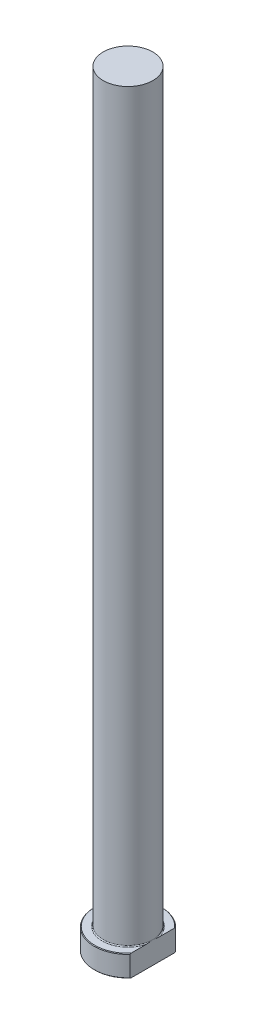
ISO-10303-21;
HEADER;
FILE_DESCRIPTION(('STEP AP214'),'2;1');
FILE_NAME('part.step','',(''),(''),'','','');
FILE_SCHEMA(('AUTOMOTIVE_DESIGN { 1 0 10303 214 1 1 1 1 }'));
ENDSEC;
DATA;
#1=APPLICATION_CONTEXT('core data for automotive mechanical design processes');
#2=APPLICATION_PROTOCOL_DEFINITION('international standard','automotive_design',2000,#1);
#3=PRODUCT_CONTEXT('',#1,'mechanical');
#4=PRODUCT('Part','Part','',(#3));
#5=PRODUCT_RELATED_PRODUCT_CATEGORY('part','',(#4));
#6=PRODUCT_DEFINITION_FORMATION('','',#4);
#7=PRODUCT_DEFINITION_CONTEXT('part definition',#1,'design');
#8=PRODUCT_DEFINITION('design','',#6,#7);
#9=PRODUCT_DEFINITION_SHAPE('','',#8);
#10=(LENGTH_UNIT() NAMED_UNIT(*) SI_UNIT(.MILLI.,.METRE.));
#11=(NAMED_UNIT(*) PLANE_ANGLE_UNIT() SI_UNIT($,.RADIAN.));
#12=(NAMED_UNIT(*) SI_UNIT($,.STERADIAN.) SOLID_ANGLE_UNIT());
#13=UNCERTAINTY_MEASURE_WITH_UNIT(LENGTH_MEASURE(1.E-05),#10,'distance_accuracy_value','');
#14=(GEOMETRIC_REPRESENTATION_CONTEXT(3) GLOBAL_UNCERTAINTY_ASSIGNED_CONTEXT((#13)) GLOBAL_UNIT_ASSIGNED_CONTEXT((#10,
#11,#12)) REPRESENTATION_CONTEXT('',''));
#15=CARTESIAN_POINT('',(0.,0.,0.));
#16=DIRECTION('',(0.,0.,1.));
#17=DIRECTION('',(1.,0.,0.));
#18=AXIS2_PLACEMENT_3D('',#15,#16,#17);
#19=CARTESIAN_POINT('',(0.,0.,0.));
#20=DIRECTION('',(0.,-1.,0.));
#21=DIRECTION('',(0.,0.,-1.));
#22=AXIS2_PLACEMENT_3D('',#19,#20,#21);
#23=PLANE('',#22);
#24=CARTESIAN_POINT('',(0.,0.,0.));
#25=DIRECTION('',(0.,-1.,0.));
#26=DIRECTION('',(0.,0.,-1.));
#27=AXIS2_PLACEMENT_3D('',#24,#25,#26);
#28=CIRCLE('',#27,10.7999999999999);
#29=CARTESIAN_POINT('',(8.09999999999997,0.,7.14352853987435));
#30=VERTEX_POINT('',#29);
#31=CARTESIAN_POINT('',(8.09999999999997,0.,-7.14352853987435));
#32=VERTEX_POINT('',#31);
#33=EDGE_CURVE('E98',#30,#32,#28,.T.);
#34=ORIENTED_EDGE('',*,*,#33,.T.);
#35=DIRECTION('',(0.,0.,1.));
#36=VECTOR('',#35,1.);
#37=CARTESIAN_POINT('',(8.09999999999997,0.,-7.44244583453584));
#38=LINE('',#37,#36);
#39=EDGE_CURVE('E83',#32,#30,#38,.T.);
#40=ORIENTED_EDGE('',*,*,#39,.T.);
#41=EDGE_LOOP('',(#34,#40));
#42=FACE_BOUND('',#41,.T.);
#43=ADVANCED_FACE('F32',(#42),#23,.T.);
#44=CARTESIAN_POINT('',(0.,259.958771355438,0.));
#45=DIRECTION('',(0.,1.,0.));
#46=DIRECTION('',(0.,0.,1.));
#47=AXIS2_PLACEMENT_3D('',#44,#45,#46);
#48=CYLINDRICAL_SURFACE('',#47,11.);
#49=CARTESIAN_POINT('',(0.,6.79999999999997,0.));
#50=DIRECTION('',(0.,1.,0.));
#51=DIRECTION('',(0.,0.,1.));
#52=AXIS2_PLACEMENT_3D('',#49,#50,#51);
#53=CIRCLE('',#52,11.);
#54=CARTESIAN_POINT('',(8.09999999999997,6.79999999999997,7.44244583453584));
#55=VERTEX_POINT('',#54);
#56=CARTESIAN_POINT('',(8.09999999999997,6.79999999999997,-7.44244583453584));
#57=VERTEX_POINT('',#56);
#58=EDGE_CURVE('E104',#55,#57,#53,.F.);
#59=ORIENTED_EDGE('',*,*,#58,.T.);
#60=DIRECTION('',(0.,-1.,0.));
#61=VECTOR('',#60,1.);
#62=CARTESIAN_POINT('',(8.09999999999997,250.,-7.44244583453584));
#63=LINE('',#62,#61);
#64=CARTESIAN_POINT('',(8.09999999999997,0.200000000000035,-7.44244583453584));
#65=VERTEX_POINT('',#64);
#66=EDGE_CURVE('E183',#57,#65,#63,.T.);
#67=ORIENTED_EDGE('',*,*,#66,.T.);
#68=CARTESIAN_POINT('',(0.,0.200000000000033,0.));
#69=DIRECTION('',(0.,-1.,0.));
#70=DIRECTION('',(0.,0.,-1.));
#71=AXIS2_PLACEMENT_3D('',#68,#69,#70);
#72=CIRCLE('',#71,11.);
#73=CARTESIAN_POINT('',(8.09999999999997,0.200000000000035,7.44244583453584));
#74=VERTEX_POINT('',#73);
#75=EDGE_CURVE('E100',#65,#74,#72,.F.);
#76=ORIENTED_EDGE('',*,*,#75,.T.);
#77=DIRECTION('',(0.,-1.,0.));
#78=VECTOR('',#77,1.);
#79=CARTESIAN_POINT('',(8.09999999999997,250.,7.44244583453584));
#80=LINE('',#79,#78);
#81=EDGE_CURVE('E93',#55,#74,#80,.T.);
#82=ORIENTED_EDGE('',*,*,#81,.F.);
#83=EDGE_LOOP('',(#59,#67,#76,#82));
#84=FACE_BOUND('',#83,.T.);
#85=ADVANCED_FACE('F158',(#84),#48,.T.);
#86=CARTESIAN_POINT('',(-11.,7.,0.));
#87=DIRECTION('',(0.,1.,0.));
#88=DIRECTION('',(0.,0.,1.));
#89=AXIS2_PLACEMENT_3D('',#86,#87,#88);
#90=PLANE('',#89);
#91=CARTESIAN_POINT('',(0.,7.,0.));
#92=DIRECTION('',(0.,1.,0.));
#93=DIRECTION('',(0.,0.,1.));
#94=AXIS2_PLACEMENT_3D('',#91,#92,#93);
#95=CIRCLE('',#94,10.8);
#96=CARTESIAN_POINT('',(8.09999999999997,7.,-7.14352853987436));
#97=VERTEX_POINT('',#96);
#98=CARTESIAN_POINT('',(8.09999999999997,7.,7.14352853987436));
#99=VERTEX_POINT('',#98);
#100=EDGE_CURVE('E178',#97,#99,#95,.T.);
#101=ORIENTED_EDGE('',*,*,#100,.T.);
#102=DIRECTION('',(0.,0.,-1.));
#103=VECTOR('',#102,1.);
#104=CARTESIAN_POINT('',(8.09999999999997,7.,0.));
#105=LINE('',#104,#103);
#106=CARTESIAN_POINT('',(8.09999999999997,6.99999999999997,2.22485954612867));
#107=VERTEX_POINT('',#106);
#108=EDGE_CURVE('E57',#99,#107,#105,.T.);
#109=ORIENTED_EDGE('',*,*,#108,.T.);
#110=CARTESIAN_POINT('',(0.,7.,0.));
#111=DIRECTION('',(0.,1.,0.));
#112=DIRECTION('',(0.,0.,1.));
#113=AXIS2_PLACEMENT_3D('',#110,#111,#112);
#114=CIRCLE('',#113,8.39999999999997);
#115=CARTESIAN_POINT('',(8.09999999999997,6.99999999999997,-2.22485954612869));
#116=VERTEX_POINT('',#115);
#117=EDGE_CURVE('E107',#107,#116,#114,.F.);
#118=ORIENTED_EDGE('',*,*,#117,.T.);
#119=EDGE_CURVE('E136',#116,#97,#105,.T.);
#120=ORIENTED_EDGE('',*,*,#119,.T.);
#121=EDGE_LOOP('',(#101,#109,#118,#120));
#122=FACE_BOUND('',#121,.T.);
#123=ADVANCED_FACE('F147',(#122),#90,.T.);
#124=CARTESIAN_POINT('',(0.,7.00000000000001,0.));
#125=DIRECTION('',(0.,-1.,0.));
#126=DIRECTION('',(0.,0.,-1.));
#127=AXIS2_PLACEMENT_3D('',#124,#125,#126);
#128=CONICAL_SURFACE('',#127,10.7999999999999,0.785398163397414);
#129=ORIENTED_EDGE('',*,*,#58,.F.);
#130=CARTESIAN_POINT('',(8.09999999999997,-0.468293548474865,16.3743869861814));
#131=CARTESIAN_POINT('',(8.09999999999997,-0.254363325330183,16.1357074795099));
#132=CARTESIAN_POINT('',(8.09999999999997,-0.0409370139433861,15.8965760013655));
#133=CARTESIAN_POINT('',(8.09999999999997,0.384762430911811,15.4172842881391));
#134=CARTESIAN_POINT('',(8.09999999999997,0.597035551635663,15.1771240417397));
#135=CARTESIAN_POINT('',(8.09999999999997,1.23203735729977,14.454764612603));
#136=CARTESIAN_POINT('',(8.09999999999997,1.65280946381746,13.9708414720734));
#137=CARTESIAN_POINT('',(8.09999999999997,2.49198203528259,12.9919134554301));
#138=CARTESIAN_POINT('',(8.09999999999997,2.91030911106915,12.4968454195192));
#139=CARTESIAN_POINT('',(8.09999999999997,3.53063151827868,11.7483710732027));
#140=CARTESIAN_POINT('',(8.09999999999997,3.73619473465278,11.4979212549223));
#141=CARTESIAN_POINT('',(8.09999999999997,4.14450356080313,10.9947372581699));
#142=CARTESIAN_POINT('',(8.09999999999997,4.34724920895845,10.7420031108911));
#143=CARTESIAN_POINT('',(8.09999999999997,4.73433340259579,10.2529152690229));
#144=CARTESIAN_POINT('',(8.09999999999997,4.91891315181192,10.0167526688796));
#145=CARTESIAN_POINT('',(8.09999999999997,5.28467709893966,9.54181650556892));
#146=CARTESIAN_POINT('',(8.09999999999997,5.46586137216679,9.30304300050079));
#147=CARTESIAN_POINT('',(8.09999999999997,5.82427381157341,8.82234050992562));
#148=CARTESIAN_POINT('',(8.09999999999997,6.00149981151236,8.58040990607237));
#149=CARTESIAN_POINT('',(8.09999999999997,6.35105499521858,8.09303329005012));
#150=CARTESIAN_POINT('',(8.09999999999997,6.52338425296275,7.84758733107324));
#151=CARTESIAN_POINT('',(8.09999999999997,6.86170981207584,7.35313784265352));
#152=CARTESIAN_POINT('',(8.09999999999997,7.02771904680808,7.10414319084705));
#153=CARTESIAN_POINT('',(8.09999999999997,7.35243924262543,6.60139153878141));
#154=CARTESIAN_POINT('',(8.09999999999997,7.51114961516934,6.34763415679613));
#155=CARTESIAN_POINT('',(8.09999999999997,7.81934238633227,5.83485140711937));
#156=CARTESIAN_POINT('',(8.09999999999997,7.96883276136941,5.57583085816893));
#157=CARTESIAN_POINT('',(8.09999999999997,8.25640202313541,5.05156426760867));
#158=CARTESIAN_POINT('',(8.09999999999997,8.39448364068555,4.7863197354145));
#159=CARTESIAN_POINT('',(8.09999999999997,8.6473354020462,4.2672067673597));
#160=CARTESIAN_POINT('',(8.09999999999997,8.76305451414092,4.01380392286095));
#161=CARTESIAN_POINT('',(8.09999999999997,8.97906757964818,3.50043611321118));
#162=CARTESIAN_POINT('',(8.09999999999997,9.07936141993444,3.24047109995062));
#163=CARTESIAN_POINT('',(8.09999999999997,9.26061269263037,2.7150721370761));
#164=CARTESIAN_POINT('',(8.09999999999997,9.34165272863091,2.4496670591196));
#165=CARTESIAN_POINT('',(8.09999999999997,9.48121180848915,1.91293243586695));
#166=CARTESIAN_POINT('',(8.09999999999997,9.53973286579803,1.64160342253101));
#167=CARTESIAN_POINT('',(8.09999999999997,9.63162156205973,1.08977238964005));
#168=CARTESIAN_POINT('',(8.09999999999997,9.66453368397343,0.809192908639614));
#169=CARTESIAN_POINT('',(8.09999999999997,9.70112845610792,0.246139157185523));
#170=CARTESIAN_POINT('',(8.09999999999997,9.70481576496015,-0.0363348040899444));
#171=CARTESIAN_POINT('',(8.09999999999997,9.68267265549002,-0.600479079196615));
#172=CARTESIAN_POINT('',(8.09999999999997,9.65680275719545,-0.882147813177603));
#173=CARTESIAN_POINT('',(8.09999999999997,9.57739238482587,-1.44154939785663));
#174=CARTESIAN_POINT('',(8.09999999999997,9.52384373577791,-1.71928106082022));
#175=CARTESIAN_POINT('',(8.09999999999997,9.37717365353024,-2.33286612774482));
#176=CARTESIAN_POINT('',(8.09999999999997,9.2777409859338,-2.6671944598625));
#177=CARTESIAN_POINT('',(8.09999999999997,9.04935963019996,-3.32555561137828));
#178=CARTESIAN_POINT('',(8.09999999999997,8.92039733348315,-3.64958360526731));
#179=CARTESIAN_POINT('',(8.09999999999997,8.70907658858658,-4.12987142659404));
#180=CARTESIAN_POINT('',(8.09999999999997,8.63516457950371,-4.28993932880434));
#181=CARTESIAN_POINT('',(8.09999999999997,8.48223226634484,-4.6076232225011));
#182=CARTESIAN_POINT('',(8.09999999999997,8.4032119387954,-4.76523920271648));
#183=CARTESIAN_POINT('',(8.09999999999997,8.24075032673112,-5.07810202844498));
#184=CARTESIAN_POINT('',(8.09999999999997,8.1573104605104,-5.23334961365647));
#185=CARTESIAN_POINT('',(8.09999999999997,7.98654878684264,-5.54168695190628));
#186=CARTESIAN_POINT('',(8.09999999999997,7.89922702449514,-5.6947767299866));
#187=CARTESIAN_POINT('',(8.09999999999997,7.66338960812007,-6.09772881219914));
#188=CARTESIAN_POINT('',(8.09999999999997,7.5119549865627,-6.34588392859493));
#189=CARTESIAN_POINT('',(8.09999999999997,7.20164049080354,-6.83751069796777));
#190=CARTESIAN_POINT('',(8.09999999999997,7.04275963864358,-7.08098172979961));
#191=CARTESIAN_POINT('',(8.09999999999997,6.71886431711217,-7.56397194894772));
#192=CARTESIAN_POINT('',(8.09999999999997,6.55384686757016,-7.80348913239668));
#193=CARTESIAN_POINT('',(8.09999999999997,6.21883875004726,-8.27899456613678));
#194=CARTESIAN_POINT('',(8.09999999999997,6.04884829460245,-8.51498296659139));
#195=CARTESIAN_POINT('',(8.09999999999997,5.70426867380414,-8.98455504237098));
#196=CARTESIAN_POINT('',(8.09999999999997,5.52966831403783,-9.21813048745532));
#197=CARTESIAN_POINT('',(8.09999999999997,5.17697958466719,-9.68263613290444));
#198=CARTESIAN_POINT('',(8.09999999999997,4.99889113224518,-9.91356627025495));
#199=CARTESIAN_POINT('',(8.09999999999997,4.46033384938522,-10.6027922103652));
#200=CARTESIAN_POINT('',(8.09999999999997,4.0954736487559,-11.0576577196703));
#201=CARTESIAN_POINT('',(8.09999999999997,3.38639212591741,-11.9247254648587));
#202=CARTESIAN_POINT('',(8.09999999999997,3.04281718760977,-12.337459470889));
#203=CARTESIAN_POINT('',(8.09999999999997,2.35005516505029,-13.1582374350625));
#204=CARTESIAN_POINT('',(8.09999999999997,2.00086766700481,-13.5662810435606));
#205=CARTESIAN_POINT('',(8.09999999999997,1.30027764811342,-14.3760884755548));
#206=CARTESIAN_POINT('',(8.09999999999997,0.94890184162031,-14.7778754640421));
#207=CARTESIAN_POINT('',(8.09999999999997,0.242699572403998,-15.57830831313));
#208=CARTESIAN_POINT('',(8.09999999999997,-0.112126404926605,-15.9769546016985));
#209=CARTESIAN_POINT('',(8.09999999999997,-0.468293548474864,-16.3743869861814));
#210=B_SPLINE_CURVE_WITH_KNOTS('',3,(#130,#131,#132,#133,#134,#135,#136,#137,#138,#139,#140,
#141,#142,#143,#144,#145,#146,#147,#148,#149,#150,#151,#152,#153,#154,#155,#156,#157,#158,#159,
#160,#161,#162,#163,#164,#165,#166,#167,#168,#169,#170,#171,#172,#173,#174,#175,#176,#177,#178,
#179,#180,#181,#182,#183,#184,#185,#186,#187,#188,#189,#190,#191,#192,#193,#194,#195,#196,#197,
#198,#199,#200,#201,#202,#203,#204,#205,#206,#207,#208,#209),.UNSPECIFIED.,.F.,.F.,(4,2,2,2,2,2,
2,2,2,2,2,2,2,2,2,2,2,2,2,2,2,2,2,2,2,2,2,2,2,2,2,2,2,2,2,2,2,2,2,4),(0.,0.961563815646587,
1.92313823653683,3.84691108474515,5.79124096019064,6.76324981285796,7.73524541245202,
8.63443178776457,9.53359819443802,10.4332451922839,11.3328785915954,12.2305594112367,
13.1283124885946,14.0252776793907,14.9220275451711,15.7573406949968,16.5926599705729,
17.424328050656,18.2559217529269,19.1019891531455,19.9479216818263,20.7949854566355,
21.6422995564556,22.6869149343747,23.732012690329,24.2608671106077,24.7897239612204,
25.3184121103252,25.8470941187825,26.7190513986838,27.5911235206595,28.4636248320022,
29.3360889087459,30.2109126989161,31.085757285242,32.8349455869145,34.4459592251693,
36.0570921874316,37.6583452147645,39.2593761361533),.UNSPECIFIED.);
#211=EDGE_CURVE('E135',#55,#99,#210,.T.);
#212=ORIENTED_EDGE('',*,*,#211,.T.);
#213=ORIENTED_EDGE('',*,*,#100,.F.);
#214=EDGE_CURVE('E127',#97,#57,#210,.T.);
#215=ORIENTED_EDGE('',*,*,#214,.T.);
#216=EDGE_LOOP('',(#129,#212,#213,#215));
#217=FACE_BOUND('',#216,.T.);
#218=ADVANCED_FACE('F143',(#217),#128,.T.);
#219=CARTESIAN_POINT('',(0.,0.200000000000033,0.));
#220=DIRECTION('',(0.,1.,0.));
#221=DIRECTION('',(0.,0.,1.));
#222=AXIS2_PLACEMENT_3D('',#219,#220,#221);
#223=CONICAL_SURFACE('',#222,11.,0.785398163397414);
#224=ORIENTED_EDGE('',*,*,#75,.F.);
#225=CARTESIAN_POINT('',(8.09999999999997,7.46829354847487,-16.3743869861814));
#226=CARTESIAN_POINT('',(8.09999999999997,7.25436332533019,-16.1357074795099));
#227=CARTESIAN_POINT('',(8.09999999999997,7.04093701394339,-15.8965760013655));
#228=CARTESIAN_POINT('',(8.09999999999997,6.6152375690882,-15.4172842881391));
#229=CARTESIAN_POINT('',(8.09999999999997,6.40296444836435,-15.1771240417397));
#230=CARTESIAN_POINT('',(8.09999999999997,5.76796264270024,-14.454764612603));
#231=CARTESIAN_POINT('',(8.09999999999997,5.34719053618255,-13.9708414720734));
#232=CARTESIAN_POINT('',(8.09999999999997,4.50801796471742,-12.9919134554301));
#233=CARTESIAN_POINT('',(8.09999999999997,4.08969088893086,-12.4968454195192));
#234=CARTESIAN_POINT('',(8.09999999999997,3.46936848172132,-11.7483710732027));
#235=CARTESIAN_POINT('',(8.09999999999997,3.26380526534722,-11.4979212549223));
#236=CARTESIAN_POINT('',(8.09999999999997,2.85549643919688,-10.9947372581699));
#237=CARTESIAN_POINT('',(8.09999999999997,2.65275079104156,-10.7420031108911));
#238=CARTESIAN_POINT('',(8.09999999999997,2.26566659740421,-10.2529152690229));
#239=CARTESIAN_POINT('',(8.09999999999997,2.08108684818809,-10.0167526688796));
#240=CARTESIAN_POINT('',(8.09999999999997,1.71532290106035,-9.54181650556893));
#241=CARTESIAN_POINT('',(8.09999999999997,1.53413862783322,-9.30304300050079));
#242=CARTESIAN_POINT('',(8.09999999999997,1.1757261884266,-8.82234050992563));
#243=CARTESIAN_POINT('',(8.09999999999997,0.998500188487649,-8.58040990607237));
#244=CARTESIAN_POINT('',(8.09999999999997,0.648945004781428,-8.09303329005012));
#245=CARTESIAN_POINT('',(8.09999999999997,0.476615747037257,-7.84758733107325));
#246=CARTESIAN_POINT('',(8.09999999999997,0.138290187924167,-7.35313784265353));
#247=CARTESIAN_POINT('',(8.09999999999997,-0.0277190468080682,-7.10414319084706));
#248=CARTESIAN_POINT('',(8.09999999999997,-0.352439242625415,-6.60139153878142));
#249=CARTESIAN_POINT('',(8.09999999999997,-0.511149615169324,-6.34763415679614));
#250=CARTESIAN_POINT('',(8.09999999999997,-0.819342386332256,-5.83485140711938));
#251=CARTESIAN_POINT('',(8.09999999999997,-0.968832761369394,-5.57583085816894));
#252=CARTESIAN_POINT('',(8.09999999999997,-1.2564020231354,-5.05156426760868));
#253=CARTESIAN_POINT('',(8.09999999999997,-1.39448364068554,-4.78631973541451));
#254=CARTESIAN_POINT('',(8.09999999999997,-1.64733540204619,-4.26720676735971));
#255=CARTESIAN_POINT('',(8.09999999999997,-1.76305451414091,-4.01380392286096));
#256=CARTESIAN_POINT('',(8.09999999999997,-1.97906757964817,-3.50043611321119));
#257=CARTESIAN_POINT('',(8.09999999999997,-2.07936141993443,-3.24047109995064));
#258=CARTESIAN_POINT('',(8.09999999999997,-2.26061269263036,-2.71507213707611));
#259=CARTESIAN_POINT('',(8.09999999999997,-2.3416527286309,-2.44966705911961));
#260=CARTESIAN_POINT('',(8.09999999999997,-2.48121180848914,-1.91293243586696));
#261=CARTESIAN_POINT('',(8.09999999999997,-2.53973286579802,-1.64160342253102));
#262=CARTESIAN_POINT('',(8.09999999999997,-2.63162156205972,-1.08977238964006));
#263=CARTESIAN_POINT('',(8.09999999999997,-2.66453368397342,-0.809192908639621));
#264=CARTESIAN_POINT('',(8.09999999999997,-2.70112845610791,-0.24613915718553));
#265=CARTESIAN_POINT('',(8.09999999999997,-2.70481576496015,0.0363348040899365));
#266=CARTESIAN_POINT('',(8.09999999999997,-2.68267265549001,0.600479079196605));
#267=CARTESIAN_POINT('',(8.09999999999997,-2.65680275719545,0.882147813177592));
#268=CARTESIAN_POINT('',(8.09999999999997,-2.57739238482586,1.44154939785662));
#269=CARTESIAN_POINT('',(8.09999999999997,-2.52384373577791,1.71928106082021));
#270=CARTESIAN_POINT('',(8.09999999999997,-2.37717365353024,2.33286612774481));
#271=CARTESIAN_POINT('',(8.09999999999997,-2.2777409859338,2.66719445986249));
#272=CARTESIAN_POINT('',(8.09999999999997,-2.04935963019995,3.32555561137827));
#273=CARTESIAN_POINT('',(8.09999999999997,-1.92039733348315,3.6495836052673));
#274=CARTESIAN_POINT('',(8.09999999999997,-1.70907658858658,4.12987142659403));
#275=CARTESIAN_POINT('',(8.09999999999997,-1.63516457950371,4.28993932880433));
#276=CARTESIAN_POINT('',(8.09999999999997,-1.48223226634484,4.60762322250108));
#277=CARTESIAN_POINT('',(8.09999999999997,-1.4032119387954,4.76523920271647));
#278=CARTESIAN_POINT('',(8.09999999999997,-1.24075032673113,5.07810202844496));
#279=CARTESIAN_POINT('',(8.09999999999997,-1.1573104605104,5.23334961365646));
#280=CARTESIAN_POINT('',(8.09999999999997,-0.986548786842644,5.54168695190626));
#281=CARTESIAN_POINT('',(8.09999999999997,-0.899227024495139,5.69477672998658));
#282=CARTESIAN_POINT('',(8.09999999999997,-0.663389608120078,6.09772881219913));
#283=CARTESIAN_POINT('',(8.09999999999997,-0.511954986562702,6.34588392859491));
#284=CARTESIAN_POINT('',(8.09999999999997,-0.201640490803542,6.83751069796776));
#285=CARTESIAN_POINT('',(8.09999999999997,-0.0427596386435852,7.08098172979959));
#286=CARTESIAN_POINT('',(8.09999999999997,0.281135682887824,7.56397194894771));
#287=CARTESIAN_POINT('',(8.09999999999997,0.446153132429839,7.80348913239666));
#288=CARTESIAN_POINT('',(8.09999999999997,0.781161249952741,8.27899456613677));
#289=CARTESIAN_POINT('',(8.09999999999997,0.951151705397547,8.51498296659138));
#290=CARTESIAN_POINT('',(8.09999999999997,1.29573132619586,8.98455504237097));
#291=CARTESIAN_POINT('',(8.09999999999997,1.47033168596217,9.21813048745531));
#292=CARTESIAN_POINT('',(8.09999999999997,1.82302041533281,9.68263613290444));
#293=CARTESIAN_POINT('',(8.09999999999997,2.00110886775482,9.91356627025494));
#294=CARTESIAN_POINT('',(8.09999999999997,2.53966615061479,10.6027922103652));
#295=CARTESIAN_POINT('',(8.09999999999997,2.90452635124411,11.0576577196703));
#296=CARTESIAN_POINT('',(8.09999999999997,3.6136078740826,11.9247254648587));
#297=CARTESIAN_POINT('',(8.09999999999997,3.95718281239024,12.337459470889));
#298=CARTESIAN_POINT('',(8.09999999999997,4.64994483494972,13.1582374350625));
#299=CARTESIAN_POINT('',(8.09999999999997,4.9991323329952,13.5662810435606));
#300=CARTESIAN_POINT('',(8.09999999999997,5.69972235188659,14.3760884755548));
#301=CARTESIAN_POINT('',(8.09999999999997,6.0510981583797,14.7778754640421));
#302=CARTESIAN_POINT('',(8.09999999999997,6.75730042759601,15.57830831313));
#303=CARTESIAN_POINT('',(8.09999999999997,7.11212640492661,15.9769546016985));
#304=CARTESIAN_POINT('',(8.09999999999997,7.46829354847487,16.3743869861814));
#305=B_SPLINE_CURVE_WITH_KNOTS('',3,(#225,#226,#227,#228,#229,#230,#231,#232,#233,#234,#235,
#236,#237,#238,#239,#240,#241,#242,#243,#244,#245,#246,#247,#248,#249,#250,#251,#252,#253,#254,
#255,#256,#257,#258,#259,#260,#261,#262,#263,#264,#265,#266,#267,#268,#269,#270,#271,#272,#273,
#274,#275,#276,#277,#278,#279,#280,#281,#282,#283,#284,#285,#286,#287,#288,#289,#290,#291,#292,
#293,#294,#295,#296,#297,#298,#299,#300,#301,#302,#303,#304),.UNSPECIFIED.,.F.,.F.,(4,2,2,2,2,2,
2,2,2,2,2,2,2,2,2,2,2,2,2,2,2,2,2,2,2,2,2,2,2,2,2,2,2,2,2,2,2,2,2,4),(0.,0.961563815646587,
1.92313823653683,3.84691108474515,5.79124096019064,6.76324981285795,7.73524541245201,
8.63443178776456,9.53359819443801,10.4332451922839,11.3328785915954,12.2305594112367,
13.1283124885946,14.0252776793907,14.9220275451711,15.7573406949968,16.5926599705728,
17.424328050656,18.2559217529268,19.1019891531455,19.9479216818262,20.7949854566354,
21.6422995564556,22.6869149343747,23.732012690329,24.2608671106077,24.7897239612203,
25.3184121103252,25.8470941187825,26.7190513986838,27.5911235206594,28.4636248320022,
29.3360889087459,30.2109126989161,31.085757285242,32.8349455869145,34.4459592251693,
36.0570921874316,37.6583452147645,39.2593761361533),.UNSPECIFIED.);
#306=EDGE_CURVE('E86',#65,#32,#305,.T.);
#307=ORIENTED_EDGE('',*,*,#306,.T.);
#308=ORIENTED_EDGE('',*,*,#33,.F.);
#309=EDGE_CURVE('E89',#30,#74,#305,.T.);
#310=ORIENTED_EDGE('',*,*,#309,.T.);
#311=EDGE_LOOP('',(#224,#307,#308,#310));
#312=FACE_BOUND('',#311,.T.);
#313=ADVANCED_FACE('F97',(#312),#223,.T.);
#314=CARTESIAN_POINT('',(0.,7.29999999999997,0.));
#315=DIRECTION('',(0.,1.,0.));
#316=DIRECTION('',(0.,0.,1.));
#317=AXIS2_PLACEMENT_3D('',#314,#315,#316);
#318=TOROIDAL_SURFACE('',#317,8.39999999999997,0.3);
#319=CARTESIAN_POINT('',(8.09999999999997,7.29999999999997,0.));
#320=CARTESIAN_POINT('',(8.09999999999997,7.30000062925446,1.10217513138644E-10));
#321=CARTESIAN_POINT('',(8.09999999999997,7.30000125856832,-3.48372532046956E-07));
#322=CARTESIAN_POINT('',(8.09999999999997,7.30000242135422,-1.24325315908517E-06));
#323=CARTESIAN_POINT('',(8.09999999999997,7.30000291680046,-1.81407064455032E-06));
#324=CARTESIAN_POINT('',(8.09999999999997,7.30000399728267,-3.20556588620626E-06));
#325=CARTESIAN_POINT('',(8.09999999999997,7.30000456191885,-4.04857468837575E-06));
#326=CARTESIAN_POINT('',(8.09999999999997,7.30000552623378,-5.7486288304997E-06));
#327=CARTESIAN_POINT('',(8.09999999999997,7.30000593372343,-6.60186051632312E-06));
#328=CARTESIAN_POINT('',(8.09999999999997,7.30000755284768,-1.00751095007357E-05));
#329=CARTESIAN_POINT('',(8.09999999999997,7.30000870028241,-1.27308878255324E-05));
#330=CARTESIAN_POINT('',(8.09999999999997,7.30001048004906,-1.78566813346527E-05));
#331=CARTESIAN_POINT('',(8.09999999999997,7.30001115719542,-2.03116208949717E-05));
#332=CARTESIAN_POINT('',(8.09999999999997,7.30001416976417,-3.11399264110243E-05));
#333=CARTESIAN_POINT('',(8.09999999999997,7.30001656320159,-3.94979192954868E-05));
#334=CARTESIAN_POINT('',(8.09999999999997,7.30001991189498,-5.49761459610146E-05));
#335=CARTESIAN_POINT('',(8.09999999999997,7.30002104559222,-6.20568593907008E-05));
#336=CARTESIAN_POINT('',(8.09999999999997,7.30002955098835,-0.000115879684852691));
#337=CARTESIAN_POINT('',(8.09999999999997,7.30003630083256,-0.00016266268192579));
#338=CARTESIAN_POINT('',(8.09999999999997,7.30006581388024,-0.000349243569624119));
#339=CARTESIAN_POINT('',(8.09999999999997,7.30009364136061,-0.000488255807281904));
#340=CARTESIAN_POINT('',(8.09999999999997,7.30020321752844,-0.00104344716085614));
#341=CARTESIAN_POINT('',(8.09999999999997,7.30028192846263,-0.00145999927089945));
#342=CARTESIAN_POINT('',(8.09999999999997,7.30059961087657,-0.00313052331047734));
#343=CARTESIAN_POINT('',(8.09999999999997,7.30084255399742,-0.0043839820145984));
#344=CARTESIAN_POINT('',(8.09999999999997,7.30186079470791,-0.00964975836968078));
#345=CARTESIAN_POINT('',(8.09999999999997,7.30263102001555,-0.0136627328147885));
#346=CARTESIAN_POINT('',(8.09999999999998,7.30867561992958,-0.045139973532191));
#347=CARTESIAN_POINT('',(8.09999999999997,7.31396742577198,-0.0726020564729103));
#348=CARTESIAN_POINT('',(8.09999999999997,7.32431115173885,-0.126405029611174));
#349=CARTESIAN_POINT('',(8.09999999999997,7.32936401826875,-0.152745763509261));
#350=CARTESIAN_POINT('',(8.09999999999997,7.34587210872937,-0.238985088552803));
#351=CARTESIAN_POINT('',(8.09999999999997,7.35728443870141,-0.298892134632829));
#352=CARTESIAN_POINT('',(8.09999999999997,7.37648902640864,-0.400785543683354));
#353=CARTESIAN_POINT('',(8.09999999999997,7.38434094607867,-0.442760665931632));
#354=CARTESIAN_POINT('',(8.09999999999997,7.39967591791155,-0.525583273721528));
#355=CARTESIAN_POINT('',(8.09999999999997,7.40716317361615,-0.566429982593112));
#356=CARTESIAN_POINT('',(8.09999999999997,7.43255561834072,-0.706751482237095));
#357=CARTESIAN_POINT('',(8.09999999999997,7.45000488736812,-0.806310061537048));
#358=CARTESIAN_POINT('',(8.09999999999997,7.48336031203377,-1.00668681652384));
#359=CARTESIAN_POINT('',(8.09999999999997,7.49924974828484,-1.10750780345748));
#360=CARTESIAN_POINT('',(8.09999999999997,7.53002321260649,-1.31956600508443));
#361=CARTESIAN_POINT('',(8.09999999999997,7.5446499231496,-1.43084155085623));
#362=CARTESIAN_POINT('',(8.09999999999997,7.56967383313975,-1.65357260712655));
#363=CARTESIAN_POINT('',(8.09999999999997,7.58008243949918,-1.76502680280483));
#364=CARTESIAN_POINT('',(8.09999999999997,7.59481704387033,-1.98455781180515));
#365=CARTESIAN_POINT('',(8.09999999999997,7.59933894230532,-2.09261973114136));
#366=CARTESIAN_POINT('',(8.09999999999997,7.6002232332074,-2.25365680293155));
#367=CARTESIAN_POINT('',(8.09999999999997,7.59957115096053,-2.30661427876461));
#368=CARTESIAN_POINT('',(8.09999999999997,7.59593025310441,-2.41243717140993));
#369=CARTESIAN_POINT('',(8.09999999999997,7.59294242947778,-2.46530261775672));
#370=CARTESIAN_POINT('',(8.09999999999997,7.58438337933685,-2.56626617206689));
#371=CARTESIAN_POINT('',(8.09999999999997,7.57905558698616,-2.61438444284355));
#372=CARTESIAN_POINT('',(8.09999999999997,7.56511668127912,-2.71063967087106));
#373=CARTESIAN_POINT('',(8.09999999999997,7.55647540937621,-2.75877261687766));
#374=CARTESIAN_POINT('',(8.09999999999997,7.53997521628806,-2.83052401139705));
#375=CARTESIAN_POINT('',(8.09999999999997,7.5338289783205,-2.85453498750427));
#376=CARTESIAN_POINT('',(8.09999999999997,7.52005528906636,-2.90212319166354));
#377=CARTESIAN_POINT('',(8.09999999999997,7.51242879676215,-2.92570068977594));
#378=CARTESIAN_POINT('',(8.09999999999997,7.49534810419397,-2.97194486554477));
#379=CARTESIAN_POINT('',(8.09999999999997,7.48591141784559,-2.99461794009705));
#380=CARTESIAN_POINT('',(8.09999999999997,7.46452687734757,-3.0387244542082));
#381=CARTESIAN_POINT('',(8.09999999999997,7.4525885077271,-3.06016219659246));
#382=CARTESIAN_POINT('',(8.09999999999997,7.43211325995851,-3.09021268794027));
#383=CARTESIAN_POINT('',(8.09999999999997,7.42496972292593,-3.09976653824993));
#384=CARTESIAN_POINT('',(8.09999999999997,7.40960263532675,-3.11798598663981));
#385=CARTESIAN_POINT('',(8.09999999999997,7.40137953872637,-3.12665195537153));
#386=CARTESIAN_POINT('',(8.09999999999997,7.3859293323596,-3.14052845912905));
#387=CARTESIAN_POINT('',(8.09999999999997,7.37898924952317,-3.14605470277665));
#388=CARTESIAN_POINT('',(8.09999999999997,7.36434419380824,-3.15598943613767));
#389=CARTESIAN_POINT('',(8.09999999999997,7.35664068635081,-3.16040001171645));
#390=CARTESIAN_POINT('',(8.09999999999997,7.34254794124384,-3.16675602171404));
#391=CARTESIAN_POINT('',(8.09999999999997,7.33631410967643,-3.16904233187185));
#392=CARTESIAN_POINT('',(8.09999999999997,7.3235539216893,-3.17255113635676));
#393=CARTESIAN_POINT('',(8.09999999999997,7.31702793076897,-3.17377492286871));
#394=CARTESIAN_POINT('',(8.09999999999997,7.30382788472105,-3.17503459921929));
#395=CARTESIAN_POINT('',(8.09999999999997,7.29715327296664,-3.17506481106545));
#396=CARTESIAN_POINT('',(8.09999999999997,7.28390757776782,-3.1739190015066));
#397=CARTESIAN_POINT('',(8.09999999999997,7.27733655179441,-3.17274233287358));
#398=CARTESIAN_POINT('',(8.09999999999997,7.26486630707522,-3.16941116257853));
#399=CARTESIAN_POINT('',(8.09999999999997,7.25895027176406,-3.16731785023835));
#400=CARTESIAN_POINT('',(8.09999999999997,7.24746822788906,-3.16233639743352));
#401=CARTESIAN_POINT('',(8.09999999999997,7.24190232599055,-3.15944801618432));
#402=CARTESIAN_POINT('',(8.09999999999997,7.22717908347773,-3.15067054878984));
#403=CARTESIAN_POINT('',(8.09999999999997,7.21840505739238,-3.14414072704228));
#404=CARTESIAN_POINT('',(8.09999999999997,7.20193704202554,-3.129833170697));
#405=CARTESIAN_POINT('',(8.09999999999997,7.19424714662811,-3.12205093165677));
#406=CARTESIAN_POINT('',(8.09999999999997,7.17324842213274,-3.0982735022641));
#407=CARTESIAN_POINT('',(8.09999999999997,7.16115297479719,-3.08121965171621));
#408=CARTESIAN_POINT('',(8.09999999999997,7.13935274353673,-3.0457024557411));
#409=CARTESIAN_POINT('',(8.09999999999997,7.12965213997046,-3.02723671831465));
#410=CARTESIAN_POINT('',(8.09999999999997,7.10752548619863,-2.97992929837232));
#411=CARTESIAN_POINT('',(8.09999999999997,7.0962106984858,-2.95057306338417));
#412=CARTESIAN_POINT('',(8.09999999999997,7.07629636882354,-2.89093361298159));
#413=CARTESIAN_POINT('',(8.09999999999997,7.06770299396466,-2.86064846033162));
#414=CARTESIAN_POINT('',(8.09999999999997,7.05247262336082,-2.79917781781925));
#415=CARTESIAN_POINT('',(8.09999999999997,7.04586259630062,-2.76798573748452));
#416=CARTESIAN_POINT('',(8.09999999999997,7.03430884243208,-2.70534539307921));
#417=CARTESIAN_POINT('',(8.09999999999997,7.02936298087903,-2.67389751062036));
#418=CARTESIAN_POINT('',(8.09999999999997,7.01745043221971,-2.58601265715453));
#419=CARTESIAN_POINT('',(8.09999999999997,7.0119543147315,-2.52937710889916));
#420=CARTESIAN_POINT('',(8.09999999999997,7.00412918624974,-2.41587715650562));
#421=CARTESIAN_POINT('',(8.09999999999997,7.00180216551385,-2.35901263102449));
#422=CARTESIAN_POINT('',(8.09999999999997,6.99963684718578,-2.24502208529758));
#423=CARTESIAN_POINT('',(8.09999999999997,6.99980818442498,-2.18789590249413));
#424=CARTESIAN_POINT('',(8.09999999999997,7.00218365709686,-2.07368289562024));
#425=CARTESIAN_POINT('',(8.09999999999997,7.00438811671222,-2.01659607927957));
#426=CARTESIAN_POINT('',(8.09999999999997,7.01309255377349,-1.85323047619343));
#427=CARTESIAN_POINT('',(8.09999999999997,7.0216582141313,-1.74706244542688));
#428=CARTESIAN_POINT('',(8.09999999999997,7.04295526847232,-1.5351174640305));
#429=CARTESIAN_POINT('',(8.09999999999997,7.05568874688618,-1.42934073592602));
#430=CARTESIAN_POINT('',(8.09999999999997,7.08235098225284,-1.2318322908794));
#431=CARTESIAN_POINT('',(8.09999999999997,7.09591325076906,-1.14005018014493));
#432=CARTESIAN_POINT('',(8.09999999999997,7.12513315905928,-0.9542946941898));
#433=CARTESIAN_POINT('',(8.09999999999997,7.14083731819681,-0.860328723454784));
#434=CARTESIAN_POINT('',(8.09999999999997,7.16870636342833,-0.70016522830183));
#435=CARTESIAN_POINT('',(8.09999999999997,7.18055718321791,-0.633912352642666));
#436=CARTESIAN_POINT('',(8.09999999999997,7.20457571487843,-0.502251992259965));
#437=CARTESIAN_POINT('',(8.09999999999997,7.21673820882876,-0.436843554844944));
#438=CARTESIAN_POINT('',(8.09999999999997,7.2398995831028,-0.313742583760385));
#439=CARTESIAN_POINT('',(8.09999999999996,7.25086777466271,-0.256044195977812));
#440=CARTESIAN_POINT('',(8.09999999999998,7.27343224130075,-0.138123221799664));
#441=CARTESIAN_POINT('',(8.1,7.28503484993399,-0.0779017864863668));
#442=CARTESIAN_POINT('',(8.09999999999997,7.29737058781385,-0.0136537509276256));
#443=CARTESIAN_POINT('',(8.09999999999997,7.29814262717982,-0.00963182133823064));
#444=CARTESIAN_POINT('',(8.09999999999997,7.29916127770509,-0.00436406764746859));
#445=CARTESIAN_POINT('',(8.09999999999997,7.29940286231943,-0.00311759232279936));
#446=CARTESIAN_POINT('',(8.09999999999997,7.29971889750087,-0.00145572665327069));
#447=CARTESIAN_POINT('',(8.09999999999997,7.29979729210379,-0.00104084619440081));
#448=CARTESIAN_POINT('',(8.09999999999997,7.29990649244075,-0.000487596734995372));
#449=CARTESIAN_POINT('',(8.09999999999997,7.29993426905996,-0.000348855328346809));
#450=CARTESIAN_POINT('',(8.09999999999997,7.29996373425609,-0.000162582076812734));
#451=CARTESIAN_POINT('',(8.09999999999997,7.29997047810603,-0.000115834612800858));
#452=CARTESIAN_POINT('',(8.09999999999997,7.29997897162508,-6.20484364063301E-05));
#453=CARTESIAN_POINT('',(8.09999999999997,7.29998010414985,-5.49694536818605E-05));
#454=CARTESIAN_POINT('',(8.09999999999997,7.2999834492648,-3.94950080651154E-05));
#455=CARTESIAN_POINT('',(8.09999999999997,7.29998584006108,-3.11389816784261E-05));
#456=CARTESIAN_POINT('',(8.09999999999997,7.2999888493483,-2.03127732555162E-05));
#457=CARTESIAN_POINT('',(8.09999999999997,7.29998952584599,-1.78579621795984E-05));
#458=CARTESIAN_POINT('',(8.09999999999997,7.29999130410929,-1.27323428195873E-05));
#459=CARTESIAN_POINT('',(8.09999999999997,7.29999245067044,-1.00765914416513E-05));
#460=CARTESIAN_POINT('',(8.09999999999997,7.29999406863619,-6.60328060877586E-06));
#461=CARTESIAN_POINT('',(8.09999999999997,7.29999447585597,-5.74999364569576E-06));
#462=CARTESIAN_POINT('',(8.09999999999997,7.29999543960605,-4.04978039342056E-06));
#463=CARTESIAN_POINT('',(8.09999999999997,7.29999600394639,-3.2066645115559E-06));
#464=CARTESIAN_POINT('',(8.09999999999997,7.29999708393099,-1.81492874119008E-06));
#465=CARTESIAN_POINT('',(8.09999999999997,7.29999757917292,-1.24398865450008E-06));
#466=CARTESIAN_POINT('',(8.09999999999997,7.29999874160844,-3.48781227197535E-07));
#467=CARTESIAN_POINT('',(8.09999999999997,7.29999937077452,-1.10212428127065E-10));
#468=CARTESIAN_POINT('',(8.09999999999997,7.29999999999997,0.));
#469=B_SPLINE_CURVE_WITH_KNOTS('',3,(#319,#320,#321,#322,#323,#324,#325,#326,#327,#328,#329,
#330,#331,#332,#333,#334,#335,#336,#337,#338,#339,#340,#341,#342,#343,#344,#345,#346,#347,#348,
#349,#350,#351,#352,#353,#354,#355,#356,#357,#358,#359,#360,#361,#362,#363,#364,#365,#366,#367,
#368,#369,#370,#371,#372,#373,#374,#375,#376,#377,#378,#379,#380,#381,#382,#383,#384,#385,#386,
#387,#388,#389,#390,#391,#392,#393,#394,#395,#396,#397,#398,#399,#400,#401,#402,#403,#404,#405,
#406,#407,#408,#409,#410,#411,#412,#413,#414,#415,#416,#417,#418,#419,#420,#421,#422,#423,#424,
#425,#426,#427,#428,#429,#430,#431,#432,#433,#434,#435,#436,#437,#438,#439,#440,#441,#442,#443,
#444,#445,#446,#447,#448,#449,#450,#451,#452,#453,#454,#455,#456,#457,#458,#459,#460,#461,#462,
#463,#464,#465,#466,#467,#468),.UNSPECIFIED.,.T.,.F.,(4,2,2,2,2,2,2,2,2,2,2,2,2,2,2,2,2,2,2,2,2,
2,2,2,2,2,2,2,2,2,2,2,2,2,2,2,2,2,2,2,2,2,2,2,2,2,2,2,2,2,2,2,2,2,2,2,2,2,2,2,2,2,2,2,2,2,2,2,2,
2,2,2,2,2,4),(0.,1.94566340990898E-06,4.24386131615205E-06,7.26038347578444E-06,
1.00975804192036E-05,1.87517574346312E-05,2.63844155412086E-05,5.24378709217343E-05,
7.39294306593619E-05,0.000215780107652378,0.000640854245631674,0.00191288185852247,
0.00574292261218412,0.0180019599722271,0.101902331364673,0.182365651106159,0.365318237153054,
0.493427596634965,0.618009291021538,0.921227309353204,1.22740416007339,1.56404340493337,
1.89976611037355,2.22400400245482,2.38285103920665,2.54163065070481,2.68679810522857,
2.83331946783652,2.90764122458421,2.98191499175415,3.05550342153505,3.12881774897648,
3.16455086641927,3.2002690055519,3.22680903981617,3.25329908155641,3.27314054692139,
3.29295784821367,3.31286941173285,3.33279165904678,3.35154918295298,3.37031239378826,
3.40293243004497,3.43567252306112,3.49804358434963,3.5605227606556,3.65467478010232,
3.74903865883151,3.84463288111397,3.94010400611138,4.11067190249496,4.28134686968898,
4.45268021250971,4.6240408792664,4.94344863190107,5.26301637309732,5.54133137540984,
5.8271264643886,6.02903811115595,6.22862558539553,6.4048211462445,6.58880446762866,
6.60109089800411,6.6048995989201,6.60616652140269,6.60659076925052,6.6067325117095,
6.60675399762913,6.60678004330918,6.60678767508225,6.60679632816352,6.60679916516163,
6.60680218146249,6.60680447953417,6.60680642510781),.UNSPECIFIED.);
#470=CARTESIAN_POINT('',(8.09999999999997,7.29999999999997,0.));
#471=VERTEX_POINT('',#470);
#472=EDGE_CURVE('E11',#116,#471,#469,.T.);
#473=ORIENTED_EDGE('',*,*,#472,.F.);
#474=ORIENTED_EDGE('',*,*,#117,.F.);
#475=CARTESIAN_POINT('',(8.09999999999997,7.29999999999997,0.));
#476=CARTESIAN_POINT('',(8.09999999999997,7.29999937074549,-1.10217625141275E-10));
#477=CARTESIAN_POINT('',(8.09999999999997,7.29999874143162,3.48372532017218E-07));
#478=CARTESIAN_POINT('',(8.09999999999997,7.29999757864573,1.24325315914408E-06));
#479=CARTESIAN_POINT('',(8.09999999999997,7.29999708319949,1.81407064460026E-06));
#480=CARTESIAN_POINT('',(8.09999999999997,7.29999600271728,3.20556588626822E-06));
#481=CARTESIAN_POINT('',(8.09999999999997,7.29999543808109,4.04857468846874E-06));
#482=CARTESIAN_POINT('',(8.09999999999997,7.29999447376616,5.74862883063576E-06));
#483=CARTESIAN_POINT('',(8.09999999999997,7.29999406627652,6.60186051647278E-06));
#484=CARTESIAN_POINT('',(8.09999999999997,7.29999244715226,1.00751095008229E-05));
#485=CARTESIAN_POINT('',(8.09999999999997,7.29999129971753,1.27308878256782E-05));
#486=CARTESIAN_POINT('',(8.09999999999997,7.29998951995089,1.78566813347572E-05));
#487=CARTESIAN_POINT('',(8.09999999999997,7.29998884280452,2.03116208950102E-05));
#488=CARTESIAN_POINT('',(8.09999999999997,7.29998583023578,3.11399264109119E-05));
#489=CARTESIAN_POINT('',(8.09999999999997,7.29998343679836,3.94979192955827E-05));
#490=CARTESIAN_POINT('',(8.09999999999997,7.29998008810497,5.49761459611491E-05));
#491=CARTESIAN_POINT('',(8.09999999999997,7.29997895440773,6.20568593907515E-05));
#492=CARTESIAN_POINT('',(8.09999999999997,7.29997044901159,0.000115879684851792));
#493=CARTESIAN_POINT('',(8.09999999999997,7.29996369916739,0.000162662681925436));
#494=CARTESIAN_POINT('',(8.09999999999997,7.29993418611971,0.000349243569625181));
#495=CARTESIAN_POINT('',(8.09999999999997,7.29990635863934,0.000488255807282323));
#496=CARTESIAN_POINT('',(8.09999999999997,7.2997967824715,0.00104344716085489));
#497=CARTESIAN_POINT('',(8.09999999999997,7.29971807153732,0.00145999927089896));
#498=CARTESIAN_POINT('',(8.09999999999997,7.29940038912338,0.00313052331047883));
#499=CARTESIAN_POINT('',(8.09999999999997,7.29915744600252,0.004383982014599));
#500=CARTESIAN_POINT('',(8.09999999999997,7.29813920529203,0.00964975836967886));
#501=CARTESIAN_POINT('',(8.09999999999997,7.29736897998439,0.0136627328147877));
#502=CARTESIAN_POINT('',(8.09999999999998,7.2913243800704,0.0451399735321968));
#503=CARTESIAN_POINT('',(8.09999999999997,7.28603257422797,0.0726020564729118));
#504=CARTESIAN_POINT('',(8.09999999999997,7.27568884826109,0.126405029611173));
#505=CARTESIAN_POINT('',(8.09999999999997,7.27063598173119,0.15274576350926));
#506=CARTESIAN_POINT('',(8.09999999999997,7.25412789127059,0.238985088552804));
#507=CARTESIAN_POINT('',(8.09999999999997,7.24271556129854,0.29889213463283));
#508=CARTESIAN_POINT('',(8.09999999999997,7.22351097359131,0.400785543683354));
#509=CARTESIAN_POINT('',(8.09999999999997,7.21565905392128,0.442760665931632));
#510=CARTESIAN_POINT('',(8.09999999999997,7.20032408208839,0.525583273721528));
#511=CARTESIAN_POINT('',(8.09999999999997,7.19283682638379,0.566429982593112));
#512=CARTESIAN_POINT('',(8.09999999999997,7.16744438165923,0.706751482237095));
#513=CARTESIAN_POINT('',(8.09999999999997,7.14999511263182,0.806310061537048));
#514=CARTESIAN_POINT('',(8.09999999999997,7.11663968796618,1.00668681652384));
#515=CARTESIAN_POINT('',(8.09999999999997,7.1007502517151,1.10750780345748));
#516=CARTESIAN_POINT('',(8.09999999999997,7.06997678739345,1.31956600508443));
#517=CARTESIAN_POINT('',(8.09999999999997,7.05535007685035,1.43084155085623));
#518=CARTESIAN_POINT('',(8.09999999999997,7.0303261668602,1.65357260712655));
#519=CARTESIAN_POINT('',(8.09999999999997,7.01991756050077,1.76502680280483));
#520=CARTESIAN_POINT('',(8.09999999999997,7.00518295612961,1.98455781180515));
#521=CARTESIAN_POINT('',(8.09999999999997,7.00066105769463,2.09261973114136));
#522=CARTESIAN_POINT('',(8.09999999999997,6.99977676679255,2.25365680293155));
#523=CARTESIAN_POINT('',(8.09999999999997,7.00042884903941,2.30661427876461));
#524=CARTESIAN_POINT('',(8.09999999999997,7.00406974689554,2.41243717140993));
#525=CARTESIAN_POINT('',(8.09999999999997,7.00705757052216,2.46530261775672));
#526=CARTESIAN_POINT('',(8.09999999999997,7.0156166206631,2.56626617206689));
#527=CARTESIAN_POINT('',(8.09999999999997,7.02094441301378,2.61438444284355));
#528=CARTESIAN_POINT('',(8.09999999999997,7.03488331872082,2.71063967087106));
#529=CARTESIAN_POINT('',(8.09999999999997,7.04352459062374,2.75877261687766));
#530=CARTESIAN_POINT('',(8.09999999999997,7.06002478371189,2.83052401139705));
#531=CARTESIAN_POINT('',(8.09999999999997,7.06617102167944,2.85453498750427));
#532=CARTESIAN_POINT('',(8.09999999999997,7.07994471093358,2.90212319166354));
#533=CARTESIAN_POINT('',(8.09999999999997,7.0875712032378,2.92570068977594));
#534=CARTESIAN_POINT('',(8.09999999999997,7.10465189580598,2.97194486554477));
#535=CARTESIAN_POINT('',(8.09999999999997,7.11408858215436,2.99461794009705));
#536=CARTESIAN_POINT('',(8.09999999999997,7.13547312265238,3.0387244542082));
#537=CARTESIAN_POINT('',(8.09999999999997,7.14741149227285,3.06016219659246));
#538=CARTESIAN_POINT('',(8.09999999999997,7.16788674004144,3.09021268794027));
#539=CARTESIAN_POINT('',(8.09999999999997,7.17503027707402,3.09976653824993));
#540=CARTESIAN_POINT('',(8.09999999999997,7.1903973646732,3.11798598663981));
#541=CARTESIAN_POINT('',(8.09999999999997,7.19862046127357,3.12665195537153));
#542=CARTESIAN_POINT('',(8.09999999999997,7.21407066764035,3.14052845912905));
#543=CARTESIAN_POINT('',(8.09999999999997,7.22101075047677,3.14605470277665));
#544=CARTESIAN_POINT('',(8.09999999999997,7.2356558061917,3.15598943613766));
#545=CARTESIAN_POINT('',(8.09999999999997,7.24335931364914,3.16040001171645));
#546=CARTESIAN_POINT('',(8.09999999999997,7.2574520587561,3.16675602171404));
#547=CARTESIAN_POINT('',(8.09999999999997,7.26368589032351,3.16904233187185));
#548=CARTESIAN_POINT('',(8.09999999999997,7.27644607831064,3.17255113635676));
#549=CARTESIAN_POINT('',(8.09999999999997,7.28297206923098,3.17377492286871));
#550=CARTESIAN_POINT('',(8.09999999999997,7.2961721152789,3.17503459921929));
#551=CARTESIAN_POINT('',(8.09999999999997,7.3028467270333,3.17506481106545));
#552=CARTESIAN_POINT('',(8.09999999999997,7.31609242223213,3.1739190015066));
#553=CARTESIAN_POINT('',(8.09999999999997,7.32266344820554,3.17274233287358));
#554=CARTESIAN_POINT('',(8.09999999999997,7.33513369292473,3.16941116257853));
#555=CARTESIAN_POINT('',(8.09999999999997,7.34104972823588,3.16731785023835));
#556=CARTESIAN_POINT('',(8.09999999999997,7.35253177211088,3.16233639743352));
#557=CARTESIAN_POINT('',(8.09999999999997,7.3580976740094,3.15944801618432));
#558=CARTESIAN_POINT('',(8.09999999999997,7.37282091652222,3.15067054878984));
#559=CARTESIAN_POINT('',(8.09999999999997,7.38159494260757,3.14414072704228));
#560=CARTESIAN_POINT('',(8.09999999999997,7.39806295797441,3.129833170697));
#561=CARTESIAN_POINT('',(8.09999999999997,7.40575285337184,3.12205093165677));
#562=CARTESIAN_POINT('',(8.09999999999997,7.42675157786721,3.0982735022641));
#563=CARTESIAN_POINT('',(8.09999999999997,7.43884702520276,3.08121965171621));
#564=CARTESIAN_POINT('',(8.09999999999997,7.46064725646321,3.0457024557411));
#565=CARTESIAN_POINT('',(8.09999999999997,7.47034786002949,3.02723671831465));
#566=CARTESIAN_POINT('',(8.09999999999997,7.49247451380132,2.97992929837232));
#567=CARTESIAN_POINT('',(8.09999999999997,7.50378930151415,2.95057306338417));
#568=CARTESIAN_POINT('',(8.09999999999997,7.52370363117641,2.89093361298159));
#569=CARTESIAN_POINT('',(8.09999999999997,7.53229700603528,2.86064846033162));
#570=CARTESIAN_POINT('',(8.09999999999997,7.54752737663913,2.79917781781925));
#571=CARTESIAN_POINT('',(8.09999999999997,7.55413740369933,2.76798573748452));
#572=CARTESIAN_POINT('',(8.09999999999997,7.56569115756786,2.70534539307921));
#573=CARTESIAN_POINT('',(8.09999999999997,7.57063701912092,2.67389751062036));
#574=CARTESIAN_POINT('',(8.09999999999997,7.58254956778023,2.58601265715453));
#575=CARTESIAN_POINT('',(8.09999999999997,7.58804568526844,2.52937710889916));
#576=CARTESIAN_POINT('',(8.09999999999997,7.59587081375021,2.41587715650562));
#577=CARTESIAN_POINT('',(8.09999999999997,7.5981978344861,2.35901263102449));
#578=CARTESIAN_POINT('',(8.09999999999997,7.60036315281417,2.24502208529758));
#579=CARTESIAN_POINT('',(8.09999999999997,7.60019181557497,2.18789590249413));
#580=CARTESIAN_POINT('',(8.09999999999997,7.59781634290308,2.07368289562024));
#581=CARTESIAN_POINT('',(8.09999999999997,7.59561188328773,2.01659607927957));
#582=CARTESIAN_POINT('',(8.09999999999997,7.58690744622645,1.85323047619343));
#583=CARTESIAN_POINT('',(8.09999999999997,7.57834178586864,1.74706244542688));
#584=CARTESIAN_POINT('',(8.09999999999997,7.55704473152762,1.5351174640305));
#585=CARTESIAN_POINT('',(8.09999999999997,7.54431125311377,1.42934073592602));
#586=CARTESIAN_POINT('',(8.09999999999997,7.51764901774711,1.2318322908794));
#587=CARTESIAN_POINT('',(8.09999999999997,7.50408674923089,1.14005018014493));
#588=CARTESIAN_POINT('',(8.09999999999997,7.47486684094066,0.9542946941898));
#589=CARTESIAN_POINT('',(8.09999999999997,7.45916268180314,0.860328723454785));
#590=CARTESIAN_POINT('',(8.09999999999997,7.43129363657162,0.70016522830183));
#591=CARTESIAN_POINT('',(8.09999999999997,7.41944281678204,0.633912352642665));
#592=CARTESIAN_POINT('',(8.09999999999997,7.39542428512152,0.502251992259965));
#593=CARTESIAN_POINT('',(8.09999999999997,7.38326179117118,0.436843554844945));
#594=CARTESIAN_POINT('',(8.09999999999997,7.36010041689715,0.313742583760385));
#595=CARTESIAN_POINT('',(8.09999999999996,7.34913222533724,0.256044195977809));
#596=CARTESIAN_POINT('',(8.09999999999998,7.32656775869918,0.138123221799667));
#597=CARTESIAN_POINT('',(8.1,7.31496515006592,0.0779017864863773));
#598=CARTESIAN_POINT('',(8.09999999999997,7.3026294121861,0.0136537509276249));
#599=CARTESIAN_POINT('',(8.09999999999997,7.30185737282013,0.00963182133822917));
#600=CARTESIAN_POINT('',(8.09999999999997,7.30083872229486,0.00436406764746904));
#601=CARTESIAN_POINT('',(8.09999999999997,7.30059713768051,0.00311759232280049));
#602=CARTESIAN_POINT('',(8.09999999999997,7.30028110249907,0.00145572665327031));
#603=CARTESIAN_POINT('',(8.09999999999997,7.30020270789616,0.00104084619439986));
#604=CARTESIAN_POINT('',(8.09999999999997,7.30009350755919,0.000487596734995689));
#605=CARTESIAN_POINT('',(8.09999999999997,7.30006573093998,0.000348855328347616));
#606=CARTESIAN_POINT('',(8.09999999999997,7.30003626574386,0.000162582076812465));
#607=CARTESIAN_POINT('',(8.09999999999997,7.30002952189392,0.000115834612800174));
#608=CARTESIAN_POINT('',(8.09999999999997,7.30002102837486,6.20484364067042E-05));
#609=CARTESIAN_POINT('',(8.09999999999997,7.30001989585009,5.49694536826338E-05));
#610=CARTESIAN_POINT('',(8.09999999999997,7.30001655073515,3.9495008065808E-05));
#611=CARTESIAN_POINT('',(8.09999999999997,7.30001415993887,3.11389816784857E-05));
#612=CARTESIAN_POINT('',(8.09999999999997,7.30001115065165,2.03127732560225E-05));
#613=CARTESIAN_POINT('',(8.09999999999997,7.30001047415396,1.78579621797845E-05));
#614=CARTESIAN_POINT('',(8.09999999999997,7.30000869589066,1.27323428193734E-05));
#615=CARTESIAN_POINT('',(8.09999999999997,7.3000075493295,1.00765914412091E-05));
#616=CARTESIAN_POINT('',(8.09999999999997,7.30000593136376,6.60328060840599E-06));
#617=CARTESIAN_POINT('',(8.09999999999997,7.30000552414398,5.74999364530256E-06));
#618=CARTESIAN_POINT('',(8.09999999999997,7.3000045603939,4.04978039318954E-06));
#619=CARTESIAN_POINT('',(8.09999999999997,7.30000399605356,3.20666451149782E-06));
#620=CARTESIAN_POINT('',(8.09999999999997,7.30000291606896,1.81492874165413E-06));
#621=CARTESIAN_POINT('',(8.09999999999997,7.30000242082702,1.24398865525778E-06));
#622=CARTESIAN_POINT('',(8.09999999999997,7.3000012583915,3.48781227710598E-07));
#623=CARTESIAN_POINT('',(8.09999999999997,7.30000062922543,1.10212540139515E-10));
#624=CARTESIAN_POINT('',(8.09999999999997,7.29999999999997,0.));
#625=B_SPLINE_CURVE_WITH_KNOTS('',3,(#475,#476,#477,#478,#479,#480,#481,#482,#483,#484,#485,
#486,#487,#488,#489,#490,#491,#492,#493,#494,#495,#496,#497,#498,#499,#500,#501,#502,#503,#504,
#505,#506,#507,#508,#509,#510,#511,#512,#513,#514,#515,#516,#517,#518,#519,#520,#521,#522,#523,
#524,#525,#526,#527,#528,#529,#530,#531,#532,#533,#534,#535,#536,#537,#538,#539,#540,#541,#542,
#543,#544,#545,#546,#547,#548,#549,#550,#551,#552,#553,#554,#555,#556,#557,#558,#559,#560,#561,
#562,#563,#564,#565,#566,#567,#568,#569,#570,#571,#572,#573,#574,#575,#576,#577,#578,#579,#580,
#581,#582,#583,#584,#585,#586,#587,#588,#589,#590,#591,#592,#593,#594,#595,#596,#597,#598,#599,
#600,#601,#602,#603,#604,#605,#606,#607,#608,#609,#610,#611,#612,#613,#614,#615,#616,#617,#618,
#619,#620,#621,#622,#623,#624),.UNSPECIFIED.,.T.,.F.,(4,2,2,2,2,2,2,2,2,2,2,2,2,2,2,2,2,2,2,2,2,
2,2,2,2,2,2,2,2,2,2,2,2,2,2,2,2,2,2,2,2,2,2,2,2,2,2,2,2,2,2,2,2,2,2,2,2,2,2,2,2,2,2,2,2,2,2,2,2,
2,2,2,2,2,4),(0.,1.94566340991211E-06,4.24386131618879E-06,7.26038347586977E-06,
1.00975804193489E-05,1.87517574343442E-05,2.6384415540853E-05,5.24378709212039E-05,
7.39294306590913E-05,0.000215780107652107,0.000640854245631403,0.0019128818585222,
0.00574292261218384,0.0180019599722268,0.101902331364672,0.182365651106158,0.365318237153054,
0.493427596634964,0.618009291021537,0.921227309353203,1.22740416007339,1.56404340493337,
1.89976611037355,2.22400400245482,2.38285103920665,2.54163065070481,2.68679810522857,
2.83331946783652,2.90764122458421,2.98191499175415,3.05550342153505,3.12881774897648,
3.16455086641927,3.2002690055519,3.22680903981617,3.25329908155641,3.27314054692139,
3.29295784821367,3.31286941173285,3.33279165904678,3.35154918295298,3.37031239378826,
3.40293243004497,3.43567252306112,3.49804358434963,3.5605227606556,3.65467478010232,
3.74903865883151,3.84463288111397,3.94010400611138,4.11067190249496,4.28134686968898,
4.45268021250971,4.6240408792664,4.94344863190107,5.26301637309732,5.54133137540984,
5.8271264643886,6.02903811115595,6.22862558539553,6.4048211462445,6.58880446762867,
6.60109089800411,6.6048995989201,6.60616652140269,6.60659076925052,6.6067325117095,
6.60675399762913,6.60678004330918,6.60678767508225,6.60679632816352,6.60679916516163,
6.60680218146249,6.60680447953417,6.60680642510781),.UNSPECIFIED.);
#626=EDGE_CURVE('E46',#471,#107,#625,.T.);
#627=ORIENTED_EDGE('',*,*,#626,.F.);
#628=CARTESIAN_POINT('',(0.,7.29999999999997,0.));
#629=DIRECTION('',(0.,1.,0.));
#630=DIRECTION('',(0.,0.,1.));
#631=AXIS2_PLACEMENT_3D('',#628,#629,#630);
#632=CIRCLE('',#631,8.09999999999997);
#633=EDGE_CURVE('E103',#471,#471,#632,.T.);
#634=ORIENTED_EDGE('',*,*,#633,.F.);
#635=EDGE_LOOP('',(#473,#474,#627,#634));
#636=FACE_BOUND('',#635,.T.);
#637=ADVANCED_FACE('F34',(#636),#318,.F.);
#638=CARTESIAN_POINT('',(0.,259.958771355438,0.));
#639=DIRECTION('',(0.,1.,0.));
#640=DIRECTION('',(0.,0.,1.));
#641=AXIS2_PLACEMENT_3D('',#638,#639,#640);
#642=CYLINDRICAL_SURFACE('',#641,8.09999999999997);
#643=ORIENTED_EDGE('',*,*,#633,.T.);
#644=EDGE_LOOP('',(#643));
#645=FACE_BOUND('',#644,.T.);
#646=CARTESIAN_POINT('',(0.,250.,0.));
#647=DIRECTION('',(0.,1.,0.));
#648=DIRECTION('',(0.,0.,1.));
#649=AXIS2_PLACEMENT_3D('',#646,#647,#648);
#650=CIRCLE('',#649,8.09999999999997);
#651=CARTESIAN_POINT('',(0.,250.,8.09999999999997));
#652=VERTEX_POINT('',#651);
#653=EDGE_CURVE('E101',#652,#652,#650,.T.);
#654=ORIENTED_EDGE('',*,*,#653,.F.);
#655=EDGE_LOOP('',(#654));
#656=FACE_BOUND('',#655,.T.);
#657=ADVANCED_FACE('F155',(#645,#656),#642,.T.);
#658=CARTESIAN_POINT('',(-8.09999999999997,250.,0.));
#659=DIRECTION('',(0.,1.,0.));
#660=DIRECTION('',(0.,0.,1.));
#661=AXIS2_PLACEMENT_3D('',#658,#659,#660);
#662=PLANE('',#661);
#663=ORIENTED_EDGE('',*,*,#653,.T.);
#664=EDGE_LOOP('',(#663));
#665=FACE_BOUND('',#664,.T.);
#666=ADVANCED_FACE('F121',(#665),#662,.T.);
#667=CARTESIAN_POINT('',(8.09999999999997,250.,-7.44244583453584));
#668=DIRECTION('',(1.,0.,0.));
#669=DIRECTION('',(0.,0.,-1.));
#670=AXIS2_PLACEMENT_3D('',#667,#668,#669);
#671=PLANE('',#670);
#672=ORIENTED_EDGE('',*,*,#66,.F.);
#673=ORIENTED_EDGE('',*,*,#214,.F.);
#674=ORIENTED_EDGE('',*,*,#119,.F.);
#675=ORIENTED_EDGE('',*,*,#472,.T.);
#676=ORIENTED_EDGE('',*,*,#626,.T.);
#677=ORIENTED_EDGE('',*,*,#108,.F.);
#678=ORIENTED_EDGE('',*,*,#211,.F.);
#679=ORIENTED_EDGE('',*,*,#81,.T.);
#680=ORIENTED_EDGE('',*,*,#309,.F.);
#681=ORIENTED_EDGE('',*,*,#39,.F.);
#682=ORIENTED_EDGE('',*,*,#306,.F.);
#683=EDGE_LOOP('',(#672,#673,#674,#675,#676,#677,#678,#679,#680,#681,#682));
#684=FACE_BOUND('',#683,.T.);
#685=ADVANCED_FACE('F85',(#684),#671,.T.);
#686=CLOSED_SHELL('',(#43,#85,#123,#218,#313,#637,#657,#666,#685));
#687=MANIFOLD_SOLID_BREP('B2',#686);
#688=ADVANCED_BREP_SHAPE_REPRESENTATION('',(#18,#687),#14);
#689=SHAPE_DEFINITION_REPRESENTATION(#9,#688);
ENDSEC;
END-ISO-10303-21;
